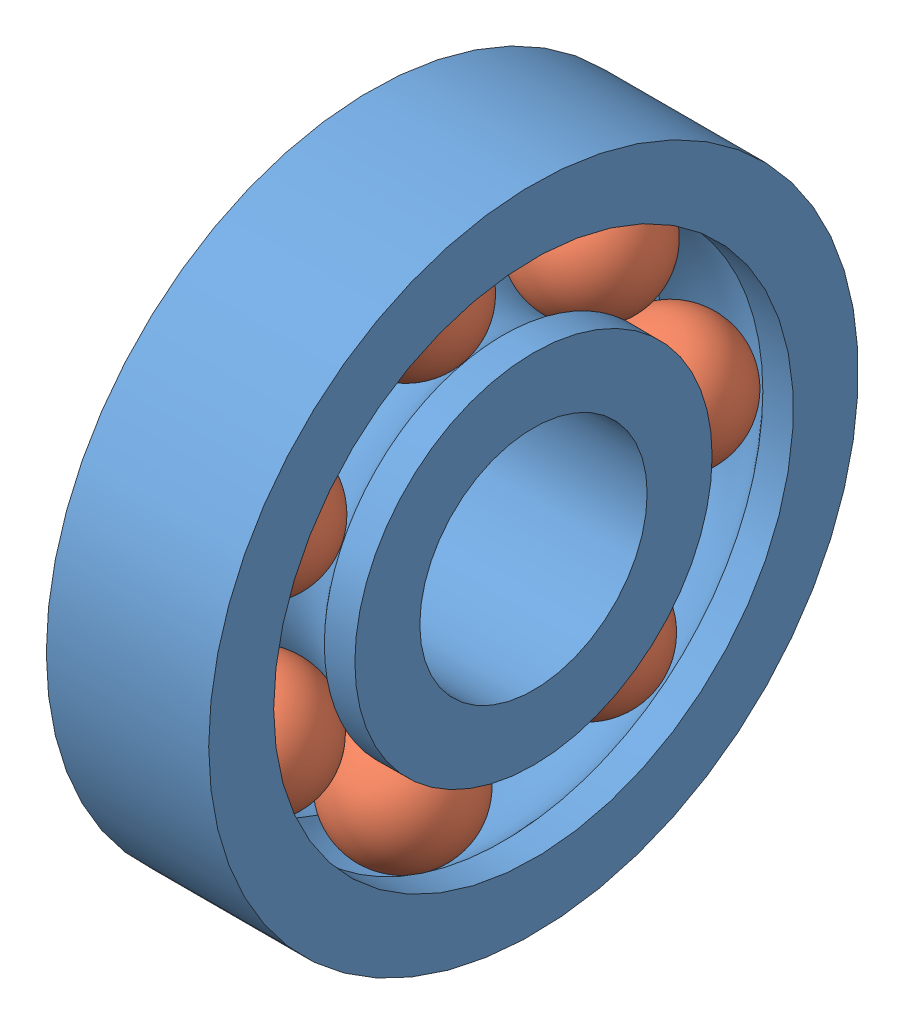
SolidWorks assembly Assem1.sldasm, configuration Default (file format 9000). Lengths in mm.
Overall size (11.93 40 40).
8 component instances, 2 part files, 2 mates.
Components (placement in the parent):
- Part1-1: Part1.SLDPRT [Default] at (12.5596 21.3149 31.4308) size (11.93 40 40)
- Part2-8: Part2.SLDPRT [Default] at (12.5837 31.7259 22.9897) x (-0.045529 -0.264645 0.963271) z (-0.948126 0.315139 0.041767) size (7.8 7.8 7.8)
- Part2-9: Part2.SLDPRT [Default] at (12.5837 34.4055 34.3075) x (-0.045529 -0.918119 0.393682) z (-0.948126 0.163831 0.272427) size (7.8 7.8 7.8)
- Part2-10: Part2.SLDPRT [Default] at (12.5837 27.2277 43.459) x (-0.045529 -0.88023 -0.472358) z (-0.948126 -0.110845 0.297943) size (7.8 7.8 7.8)
- Part2-11: Part2.SLDPRT [Default] at (12.5837 15.5975 43.5531) x (-0.045529 -0.17951 -0.982702) z (-0.948126 -0.302052 0.099103) size (7.8 7.8 7.8)
- Part2-12: Part2.SLDPRT [Default] at (12.5837 8.2726 34.5188) x (-0.045529 0.656384 -0.753052) z (-0.948126 -0.265808 -0.174364) size (7.8 7.8 7.8)
- Part2-13: Part2.SLDPRT [Default] at (12.5837 10.7688 23.1592) x (-0.045529 0.998008 0.043662) z (-0.948126 -0.029405 -0.316531) size (7.8 7.8 7.8)
- Part2-14: Part2.SLDPRT [Default] at (12.5837 21.2065 18.0283) x (-0.045529 0.588112 0.807497) z (-0.948126 0.229141 -0.220344) size (7.8 7.8 7.8)
Mates (geometry in assembly coordinates):
- Tangent5: tangent: torus of Part1-1; sphere of Part2-8
- Tangent6: tangent: torus of Part1-1; sphere of Part2-8
